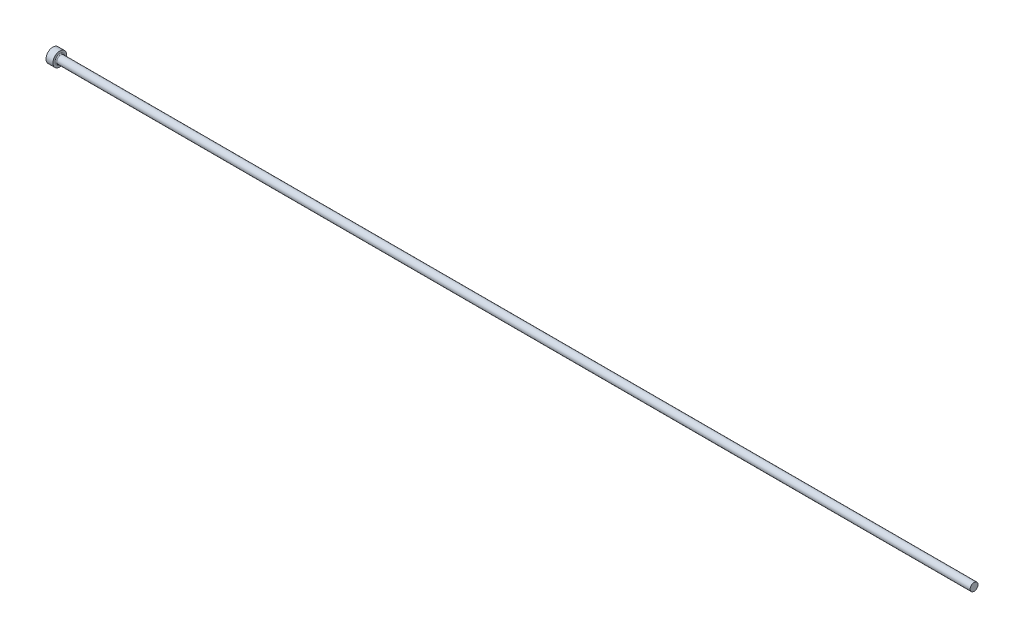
ISO-10303-21;
HEADER;
FILE_DESCRIPTION(('STEP AP214'),'2;1');
FILE_NAME('part.step','',(''),(''),'','','');
FILE_SCHEMA(('AUTOMOTIVE_DESIGN { 1 0 10303 214 1 1 1 1 }'));
ENDSEC;
DATA;
#1=APPLICATION_CONTEXT('core data for automotive mechanical design processes');
#2=APPLICATION_PROTOCOL_DEFINITION('international standard','automotive_design',2000,#1);
#3=PRODUCT_CONTEXT('',#1,'mechanical');
#4=PRODUCT('Part','Part','',(#3));
#5=PRODUCT_RELATED_PRODUCT_CATEGORY('part','',(#4));
#6=PRODUCT_DEFINITION_FORMATION('','',#4);
#7=PRODUCT_DEFINITION_CONTEXT('part definition',#1,'design');
#8=PRODUCT_DEFINITION('design','',#6,#7);
#9=PRODUCT_DEFINITION_SHAPE('','',#8);
#10=(LENGTH_UNIT() NAMED_UNIT(*) SI_UNIT(.MILLI.,.METRE.));
#11=(NAMED_UNIT(*) PLANE_ANGLE_UNIT() SI_UNIT($,.RADIAN.));
#12=(NAMED_UNIT(*) SI_UNIT($,.STERADIAN.) SOLID_ANGLE_UNIT());
#13=UNCERTAINTY_MEASURE_WITH_UNIT(LENGTH_MEASURE(1.E-05),#10,'distance_accuracy_value','');
#14=(GEOMETRIC_REPRESENTATION_CONTEXT(3) GLOBAL_UNCERTAINTY_ASSIGNED_CONTEXT((#13)) GLOBAL_UNIT_ASSIGNED_CONTEXT((#10,
#11,#12)) REPRESENTATION_CONTEXT('',''));
#15=CARTESIAN_POINT('',(0.,0.,0.));
#16=DIRECTION('',(0.,0.,1.));
#17=DIRECTION('',(1.,0.,0.));
#18=AXIS2_PLACEMENT_3D('',#15,#16,#17);
#19=CARTESIAN_POINT('',(0.,0.,0.));
#20=DIRECTION('',(-1.,0.,0.));
#21=DIRECTION('',(0.,-1.,0.));
#22=AXIS2_PLACEMENT_3D('',#19,#20,#21);
#23=PLANE('',#22);
#24=CARTESIAN_POINT('',(0.,0.,0.));
#25=DIRECTION('',(1.,0.,0.));
#26=DIRECTION('',(0.,1.,0.));
#27=AXIS2_PLACEMENT_3D('',#24,#25,#26);
#28=CIRCLE('',#27,1.5);
#29=CARTESIAN_POINT('',(0.,1.5,0.));
#30=VERTEX_POINT('',#29);
#31=EDGE_CURVE('E30',#30,#30,#28,.T.);
#32=ORIENTED_EDGE('',*,*,#31,.F.);
#33=EDGE_LOOP('',(#32));
#34=FACE_BOUND('',#33,.T.);
#35=ADVANCED_FACE('F14',(#34),#23,.T.);
#36=CARTESIAN_POINT('',(200.,0.,0.));
#37=DIRECTION('',(1.,0.,0.));
#38=DIRECTION('',(0.,1.,0.));
#39=AXIS2_PLACEMENT_3D('',#36,#37,#38);
#40=CYLINDRICAL_SURFACE('',#39,1.5);
#41=ORIENTED_EDGE('',*,*,#31,.T.);
#42=EDGE_LOOP('',(#41));
#43=FACE_BOUND('',#42,.T.);
#44=CARTESIAN_POINT('',(1.5,0.,0.));
#45=DIRECTION('',(1.,0.,0.));
#46=DIRECTION('',(0.,1.,0.));
#47=AXIS2_PLACEMENT_3D('',#44,#45,#46);
#48=CIRCLE('',#47,1.5);
#49=CARTESIAN_POINT('',(1.5,1.5,0.));
#50=VERTEX_POINT('',#49);
#51=EDGE_CURVE('E35',#50,#50,#48,.T.);
#52=ORIENTED_EDGE('',*,*,#51,.F.);
#53=EDGE_LOOP('',(#52));
#54=FACE_BOUND('',#53,.T.);
#55=ADVANCED_FACE('F55',(#43,#54),#40,.T.);
#56=CARTESIAN_POINT('',(1.5,1.5,0.));
#57=DIRECTION('',(1.,0.,0.));
#58=DIRECTION('',(0.,1.,0.));
#59=AXIS2_PLACEMENT_3D('',#56,#57,#58);
#60=PLANE('',#59);
#61=CARTESIAN_POINT('',(1.5,0.,0.));
#62=DIRECTION('',(1.,0.,0.));
#63=DIRECTION('',(0.,1.,0.));
#64=AXIS2_PLACEMENT_3D('',#61,#62,#63);
#65=CIRCLE('',#64,1.04999999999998);
#66=CARTESIAN_POINT('',(1.5,1.04999999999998,0.));
#67=VERTEX_POINT('',#66);
#68=EDGE_CURVE('E9',#67,#67,#65,.F.);
#69=ORIENTED_EDGE('',*,*,#68,.T.);
#70=EDGE_LOOP('',(#69));
#71=FACE_BOUND('',#70,.T.);
#72=ORIENTED_EDGE('',*,*,#51,.T.);
#73=EDGE_LOOP('',(#72));
#74=FACE_BOUND('',#73,.T.);
#75=ADVANCED_FACE('F48',(#71,#74),#60,.T.);
#76=CARTESIAN_POINT('',(200.,0.,0.));
#77=DIRECTION('',(1.,0.,0.));
#78=DIRECTION('',(0.,1.,0.));
#79=AXIS2_PLACEMENT_3D('',#76,#77,#78);
#80=CYLINDRICAL_SURFACE('',#79,0.849999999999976);
#81=CARTESIAN_POINT('',(1.7,0.,0.));
#82=DIRECTION('',(1.,0.,0.));
#83=DIRECTION('',(0.,1.,0.));
#84=AXIS2_PLACEMENT_3D('',#81,#82,#83);
#85=CIRCLE('',#84,0.849999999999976);
#86=CARTESIAN_POINT('',(1.7,0.849999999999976,0.));
#87=VERTEX_POINT('',#86);
#88=EDGE_CURVE('E22',#87,#87,#85,.T.);
#89=ORIENTED_EDGE('',*,*,#88,.T.);
#90=EDGE_LOOP('',(#89));
#91=FACE_BOUND('',#90,.T.);
#92=CARTESIAN_POINT('',(200.,0.,0.));
#93=DIRECTION('',(1.,0.,0.));
#94=DIRECTION('',(0.,1.,0.));
#95=AXIS2_PLACEMENT_3D('',#92,#93,#94);
#96=CIRCLE('',#95,0.849999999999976);
#97=CARTESIAN_POINT('',(200.,0.849999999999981,0.));
#98=VERTEX_POINT('',#97);
#99=EDGE_CURVE('E40',#98,#98,#96,.T.);
#100=ORIENTED_EDGE('',*,*,#99,.F.);
#101=EDGE_LOOP('',(#100));
#102=FACE_BOUND('',#101,.T.);
#103=ADVANCED_FACE('F46',(#91,#102),#80,.T.);
#104=CARTESIAN_POINT('',(200.,0.849999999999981,0.));
#105=DIRECTION('',(1.,0.,0.));
#106=DIRECTION('',(0.,1.,0.));
#107=AXIS2_PLACEMENT_3D('',#104,#105,#106);
#108=PLANE('',#107);
#109=ORIENTED_EDGE('',*,*,#99,.T.);
#110=EDGE_LOOP('',(#109));
#111=FACE_BOUND('',#110,.T.);
#112=ADVANCED_FACE('F44',(#111),#108,.T.);
#113=CARTESIAN_POINT('',(1.7,0.,0.));
#114=DIRECTION('',(1.,0.,0.));
#115=DIRECTION('',(0.,1.,0.));
#116=AXIS2_PLACEMENT_3D('',#113,#114,#115);
#117=TOROIDAL_SURFACE('',#116,1.04999999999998,0.2);
#118=ORIENTED_EDGE('',*,*,#68,.F.);
#119=EDGE_LOOP('',(#118));
#120=FACE_BOUND('',#119,.T.);
#121=ORIENTED_EDGE('',*,*,#88,.F.);
#122=EDGE_LOOP('',(#121));
#123=FACE_BOUND('',#122,.T.);
#124=ADVANCED_FACE('F16',(#120,#123),#117,.F.);
#125=CLOSED_SHELL('',(#35,#55,#75,#103,#112,#124));
#126=MANIFOLD_SOLID_BREP('B1',#125);
#127=ADVANCED_BREP_SHAPE_REPRESENTATION('',(#18,#126),#14);
#128=SHAPE_DEFINITION_REPRESENTATION(#9,#127);
ENDSEC;
END-ISO-10303-21;
